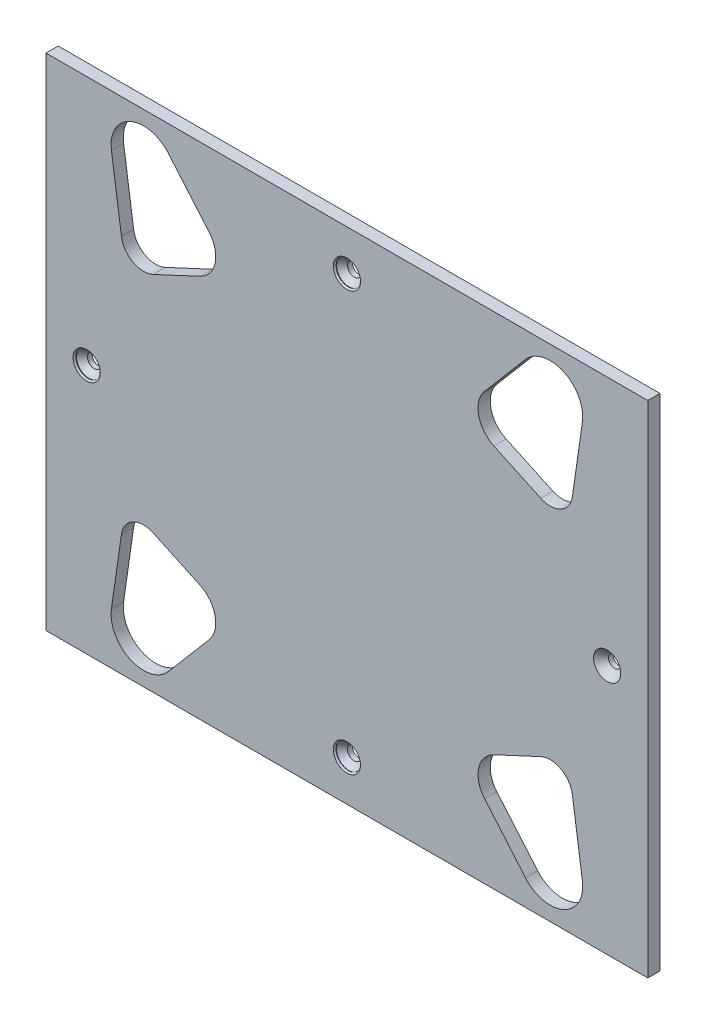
ISO-10303-21;
HEADER;
FILE_DESCRIPTION(('STEP AP214'),'2;1');
FILE_NAME('part.step','',(''),(''),'','','');
FILE_SCHEMA(('AUTOMOTIVE_DESIGN { 1 0 10303 214 1 1 1 1 }'));
ENDSEC;
DATA;
#1=APPLICATION_CONTEXT('core data for automotive mechanical design processes');
#2=APPLICATION_PROTOCOL_DEFINITION('international standard','automotive_design',2000,#1);
#3=PRODUCT_CONTEXT('',#1,'mechanical');
#4=PRODUCT('Part','Part','',(#3));
#5=PRODUCT_RELATED_PRODUCT_CATEGORY('part','',(#4));
#6=PRODUCT_DEFINITION_FORMATION('','',#4);
#7=PRODUCT_DEFINITION_CONTEXT('part definition',#1,'design');
#8=PRODUCT_DEFINITION('design','',#6,#7);
#9=PRODUCT_DEFINITION_SHAPE('','',#8);
#10=(LENGTH_UNIT() NAMED_UNIT(*) SI_UNIT(.MILLI.,.METRE.));
#11=(NAMED_UNIT(*) PLANE_ANGLE_UNIT() SI_UNIT($,.RADIAN.));
#12=(NAMED_UNIT(*) SI_UNIT($,.STERADIAN.) SOLID_ANGLE_UNIT());
#13=UNCERTAINTY_MEASURE_WITH_UNIT(LENGTH_MEASURE(1.E-05),#10,'distance_accuracy_value','');
#14=(GEOMETRIC_REPRESENTATION_CONTEXT(3) GLOBAL_UNCERTAINTY_ASSIGNED_CONTEXT((#13)) GLOBAL_UNIT_ASSIGNED_CONTEXT((#10,
#11,#12)) REPRESENTATION_CONTEXT('',''));
#15=CARTESIAN_POINT('',(0.,0.,0.));
#16=DIRECTION('',(0.,0.,1.));
#17=DIRECTION('',(1.,0.,0.));
#18=AXIS2_PLACEMENT_3D('',#15,#16,#17);
#19=CARTESIAN_POINT('',(-128.,0.,55.2134967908));
#20=DIRECTION('',(0.,0.,-1.));
#21=DIRECTION('',(-1.,0.,0.));
#22=AXIS2_PLACEMENT_3D('',#19,#20,#21);
#23=CYLINDRICAL_SURFACE('',#22,6.);
#24=CARTESIAN_POINT('',(-128.,0.,5.01349679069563));
#25=DIRECTION('',(0.,0.,1.));
#26=DIRECTION('',(0.877582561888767,-0.479425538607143,0.));
#27=AXIS2_PLACEMENT_3D('',#24,#25,#26);
#28=CIRCLE('',#27,5.9999999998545);
#29=CARTESIAN_POINT('',(-122.734504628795,-2.8765532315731,5.01349679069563));
#30=VERTEX_POINT('',#29);
#31=EDGE_CURVE('E237',#30,#30,#28,.F.);
#32=ORIENTED_EDGE('',*,*,#31,.T.);
#33=EDGE_LOOP('',(#32));
#34=FACE_BOUND('',#33,.T.);
#35=CARTESIAN_POINT('',(-128.,0.,5.2999999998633));
#36=DIRECTION('',(0.,0.,1.));
#37=DIRECTION('',(0.877582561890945,-0.479425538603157,0.));
#38=AXIS2_PLACEMENT_3D('',#35,#36,#37);
#39=CIRCLE('',#38,5.99999999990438);
#40=CARTESIAN_POINT('',(-122.734504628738,-2.8765532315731,5.2999999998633));
#41=VERTEX_POINT('',#40);
#42=EDGE_CURVE('E240',#41,#41,#39,.T.);
#43=ORIENTED_EDGE('',*,*,#42,.T.);
#44=EDGE_LOOP('',(#43));
#45=FACE_BOUND('',#44,.T.);
#46=ADVANCED_FACE('F16',(#34,#45),#23,.F.);
#47=CARTESIAN_POINT('',(0.,-103.,55.3155203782));
#48=DIRECTION('',(0.,0.,-1.));
#49=DIRECTION('',(-1.,0.,0.));
#50=AXIS2_PLACEMENT_3D('',#47,#48,#49);
#51=CYLINDRICAL_SURFACE('',#50,6.);
#52=CARTESIAN_POINT('',(0.,-103.,5.11552037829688));
#53=DIRECTION('',(0.,0.,1.));
#54=DIRECTION('',(0.877582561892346,-0.479425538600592,0.));
#55=AXIS2_PLACEMENT_3D('',#52,#53,#54);
#56=CIRCLE('',#55,6.00000000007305);
#57=CARTESIAN_POINT('',(5.26549537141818,-105.876553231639,5.11552037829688));
#58=VERTEX_POINT('',#57);
#59=EDGE_CURVE('E234',#58,#58,#56,.F.);
#60=ORIENTED_EDGE('',*,*,#59,.T.);
#61=EDGE_LOOP('',(#60));
#62=FACE_BOUND('',#61,.T.);
#63=CARTESIAN_POINT('',(0.,-103.,5.30000000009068));
#64=DIRECTION('',(0.,0.,1.));
#65=DIRECTION('',(0.87758256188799,-0.479425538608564,0.));
#66=AXIS2_PLACEMENT_3D('',#63,#64,#65);
#67=CIRCLE('',#66,5.99999999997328);
#68=CARTESIAN_POINT('',(5.2654953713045,-105.876553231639,5.30000000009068));
#69=VERTEX_POINT('',#68);
#70=EDGE_CURVE('E243',#69,#69,#67,.T.);
#71=ORIENTED_EDGE('',*,*,#70,.T.);
#72=EDGE_LOOP('',(#71));
#73=FACE_BOUND('',#72,.T.);
#74=ADVANCED_FACE('F872',(#62,#73),#51,.F.);
#75=CARTESIAN_POINT('',(0.,103.,55.2576178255));
#76=DIRECTION('',(0.,0.,-1.));
#77=DIRECTION('',(-1.,0.,0.));
#78=AXIS2_PLACEMENT_3D('',#75,#76,#77);
#79=CYLINDRICAL_SURFACE('',#78,6.);
#80=CARTESIAN_POINT('',(0.,103.,5.05761782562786));
#81=DIRECTION('',(0.,0.,1.));
#82=DIRECTION('',(0.877582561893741,-0.479425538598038,0.));
#83=AXIS2_PLACEMENT_3D('',#80,#81,#82);
#84=CIRCLE('',#83,6.00000000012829);
#85=CARTESIAN_POINT('',(5.26549537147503,100.12344676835,5.05761782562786));
#86=VERTEX_POINT('',#85);
#87=EDGE_CURVE('E231',#86,#86,#84,.F.);
#88=ORIENTED_EDGE('',*,*,#87,.T.);
#89=EDGE_LOOP('',(#88));
#90=FACE_BOUND('',#89,.T.);
#91=CARTESIAN_POINT('',(0.,103.,5.30000000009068));
#92=DIRECTION('',(0.,0.,1.));
#93=DIRECTION('',(0.877582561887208,-0.479425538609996,0.));
#94=AXIS2_PLACEMENT_3D('',#91,#92,#93);
#95=CIRCLE('',#94,5.99999999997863);
#96=CARTESIAN_POINT('',(5.2654953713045,100.12344676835,5.30000000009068));
#97=VERTEX_POINT('',#96);
#98=EDGE_CURVE('E246',#97,#97,#95,.T.);
#99=ORIENTED_EDGE('',*,*,#98,.T.);
#100=EDGE_LOOP('',(#99));
#101=FACE_BOUND('',#100,.T.);
#102=ADVANCED_FACE('F864',(#90,#101),#79,.F.);
#103=CARTESIAN_POINT('',(0.,103.,6.00000000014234));
#104=DIRECTION('',(0.,0.,1.));
#105=DIRECTION('',(1.,0.,0.));
#106=AXIS2_PLACEMENT_3D('',#103,#104,#105);
#107=CONICAL_SURFACE('',#106,6.70000000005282,0.785398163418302);
#108=CARTESIAN_POINT('',(0.,103.,6.00000000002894));
#109=DIRECTION('',(0.,0.,1.));
#110=DIRECTION('',(1.,0.,0.));
#111=AXIS2_PLACEMENT_3D('',#108,#109,#110);
#112=CIRCLE('',#111,6.69999999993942);
#113=CARTESIAN_POINT('',(6.69999999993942,103.,6.00000000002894));
#114=VERTEX_POINT('',#113);
#115=EDGE_CURVE('E350',#114,#114,#112,.F.);
#116=ORIENTED_EDGE('',*,*,#115,.F.);
#117=EDGE_LOOP('',(#116));
#118=FACE_BOUND('',#117,.T.);
#119=ORIENTED_EDGE('',*,*,#98,.F.);
#120=EDGE_LOOP('',(#119));
#121=FACE_BOUND('',#120,.T.);
#122=ADVANCED_FACE('F856',(#118,#121),#107,.F.);
#123=CARTESIAN_POINT('',(0.,-103.,6.00000000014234));
#124=DIRECTION('',(0.,0.,1.));
#125=DIRECTION('',(1.,0.,0.));
#126=AXIS2_PLACEMENT_3D('',#123,#124,#125);
#127=CONICAL_SURFACE('',#126,6.70000000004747,0.785398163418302);
#128=CARTESIAN_POINT('',(0.,-103.,6.00000000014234));
#129=DIRECTION('',(0.,0.,1.));
#130=DIRECTION('',(1.,0.,0.));
#131=AXIS2_PLACEMENT_3D('',#128,#129,#130);
#132=CIRCLE('',#131,6.70000000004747);
#133=CARTESIAN_POINT('',(6.70000000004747,-103.,6.00000000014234));
#134=VERTEX_POINT('',#133);
#135=EDGE_CURVE('E348',#134,#134,#132,.F.);
#136=ORIENTED_EDGE('',*,*,#135,.F.);
#137=EDGE_LOOP('',(#136));
#138=FACE_BOUND('',#137,.T.);
#139=ORIENTED_EDGE('',*,*,#70,.F.);
#140=EDGE_LOOP('',(#139));
#141=FACE_BOUND('',#140,.T.);
#142=ADVANCED_FACE('F848',(#138,#141),#127,.F.);
#143=CARTESIAN_POINT('',(-128.,0.,6.00000000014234));
#144=DIRECTION('',(0.,0.,1.));
#145=DIRECTION('',(1.,0.,0.));
#146=AXIS2_PLACEMENT_3D('',#143,#144,#145);
#147=CONICAL_SURFACE('',#146,6.70000000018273,0.785398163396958);
#148=CARTESIAN_POINT('',(-128.,0.,6.00000000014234));
#149=DIRECTION('',(0.,0.,1.));
#150=DIRECTION('',(1.,0.,0.));
#151=AXIS2_PLACEMENT_3D('',#148,#149,#150);
#152=CIRCLE('',#151,6.70000000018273);
#153=CARTESIAN_POINT('',(-121.299999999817,0.,6.00000000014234));
#154=VERTEX_POINT('',#153);
#155=EDGE_CURVE('E344',#154,#154,#152,.F.);
#156=ORIENTED_EDGE('',*,*,#155,.F.);
#157=EDGE_LOOP('',(#156));
#158=FACE_BOUND('',#157,.T.);
#159=ORIENTED_EDGE('',*,*,#42,.F.);
#160=EDGE_LOOP('',(#159));
#161=FACE_BOUND('',#160,.T.);
#162=ADVANCED_FACE('F840',(#158,#161),#147,.F.);
#163=CARTESIAN_POINT('',(-128.,0.,5.01349679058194));
#164=DIRECTION('',(0.,0.,1.));
#165=DIRECTION('',(1.,0.,0.));
#166=AXIS2_PLACEMENT_3D('',#163,#164,#165);
#167=CONICAL_SURFACE('',#166,5.99999999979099,0.785398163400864);
#168=ORIENTED_EDGE('',*,*,#31,.F.);
#169=EDGE_LOOP('',(#168));
#170=FACE_BOUND('',#169,.T.);
#171=CARTESIAN_POINT('',(-128.,0.,2.3134967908));
#172=DIRECTION('',(0.,0.,-1.));
#173=DIRECTION('',(-1.,0.,0.));
#174=AXIS2_PLACEMENT_3D('',#171,#172,#173);
#175=CIRCLE('',#174,3.3);
#176=CARTESIAN_POINT('',(-131.3,0.,2.3134967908));
#177=VERTEX_POINT('',#176);
#178=EDGE_CURVE('E227',#177,#177,#175,.T.);
#179=ORIENTED_EDGE('',*,*,#178,.T.);
#180=EDGE_LOOP('',(#179));
#181=FACE_BOUND('',#180,.T.);
#182=ADVANCED_FACE('F832',(#170,#181),#167,.F.);
#183=CARTESIAN_POINT('',(0.,-103.,5.11552037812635));
#184=DIRECTION('',(0.,0.,1.));
#185=DIRECTION('',(0.,-1.,0.));
#186=AXIS2_PLACEMENT_3D('',#183,#184,#185);
#187=CONICAL_SURFACE('',#186,5.99999999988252,0.785398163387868);
#188=ORIENTED_EDGE('',*,*,#59,.F.);
#189=EDGE_LOOP('',(#188));
#190=FACE_BOUND('',#189,.T.);
#191=CARTESIAN_POINT('',(0.,-103.,2.41552037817));
#192=DIRECTION('',(0.,0.,-1.));
#193=DIRECTION('',(-1.,0.,0.));
#194=AXIS2_PLACEMENT_3D('',#191,#192,#193);
#195=CIRCLE('',#194,3.3);
#196=CARTESIAN_POINT('',(-3.3,-103.,2.41552037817));
#197=VERTEX_POINT('',#196);
#198=EDGE_CURVE('E224',#197,#197,#195,.T.);
#199=ORIENTED_EDGE('',*,*,#198,.T.);
#200=EDGE_LOOP('',(#199));
#201=FACE_BOUND('',#200,.T.);
#202=ADVANCED_FACE('F371',(#190,#201),#187,.F.);
#203=CARTESIAN_POINT('',(0.,103.,5.05761782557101));
#204=DIRECTION('',(0.,0.,1.));
#205=DIRECTION('',(0.,-1.,0.));
#206=AXIS2_PLACEMENT_3D('',#203,#204,#205);
#207=CONICAL_SURFACE('',#206,6.00000000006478,0.785398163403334);
#208=ORIENTED_EDGE('',*,*,#87,.F.);
#209=EDGE_LOOP('',(#208));
#210=FACE_BOUND('',#209,.T.);
#211=CARTESIAN_POINT('',(0.,103.,2.35761782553));
#212=DIRECTION('',(0.,0.,-1.));
#213=DIRECTION('',(-1.,0.,0.));
#214=AXIS2_PLACEMENT_3D('',#211,#212,#213);
#215=CIRCLE('',#214,3.3);
#216=CARTESIAN_POINT('',(-3.3,103.,2.35761782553));
#217=VERTEX_POINT('',#216);
#218=EDGE_CURVE('E221',#217,#217,#215,.T.);
#219=ORIENTED_EDGE('',*,*,#218,.T.);
#220=EDGE_LOOP('',(#219));
#221=FACE_BOUND('',#220,.T.);
#222=ADVANCED_FACE('F360',(#210,#221),#207,.F.);
#223=CARTESIAN_POINT('',(128.,0.,6.00000000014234));
#224=DIRECTION('',(0.,0.,1.));
#225=DIRECTION('',(1.,0.,0.));
#226=AXIS2_PLACEMENT_3D('',#223,#224,#225);
#227=CONICAL_SURFACE('',#226,6.70000000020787,0.785398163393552);
#228=CARTESIAN_POINT('',(128.,0.,2.3));
#229=DIRECTION('',(0.,0.,-1.));
#230=DIRECTION('',(-1.,0.,0.));
#231=AXIS2_PLACEMENT_3D('',#228,#229,#230);
#232=CIRCLE('',#231,3.);
#233=CARTESIAN_POINT('',(125.,0.,2.3));
#234=VERTEX_POINT('',#233);
#235=EDGE_CURVE('E189',#234,#234,#232,.T.);
#236=ORIENTED_EDGE('',*,*,#235,.T.);
#237=EDGE_LOOP('',(#236));
#238=FACE_BOUND('',#237,.T.);
#239=CARTESIAN_POINT('',(128.,0.,6.00000000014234));
#240=DIRECTION('',(0.,0.,1.));
#241=DIRECTION('',(1.,0.,0.));
#242=AXIS2_PLACEMENT_3D('',#239,#240,#241);
#243=CIRCLE('',#242,6.70000000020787);
#244=CARTESIAN_POINT('',(134.700000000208,0.,6.00000000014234));
#245=VERTEX_POINT('',#244);
#246=EDGE_CURVE('E20',#245,#245,#243,.F.);
#247=ORIENTED_EDGE('',*,*,#246,.F.);
#248=EDGE_LOOP('',(#247));
#249=FACE_BOUND('',#248,.T.);
#250=ADVANCED_FACE('F358',(#238,#249),#227,.F.);
#251=CARTESIAN_POINT('',(0.,0.,6.));
#252=DIRECTION('',(0.,0.,1.));
#253=DIRECTION('',(1.,0.,0.));
#254=AXIS2_PLACEMENT_3D('',#251,#252,#253);
#255=PLANE('',#254);
#256=ORIENTED_EDGE('',*,*,#155,.T.);
#257=EDGE_LOOP('',(#256));
#258=FACE_BOUND('',#257,.T.);
#259=ORIENTED_EDGE('',*,*,#135,.T.);
#260=EDGE_LOOP('',(#259));
#261=FACE_BOUND('',#260,.T.);
#262=ORIENTED_EDGE('',*,*,#115,.T.);
#263=EDGE_LOOP('',(#262));
#264=FACE_BOUND('',#263,.T.);
#265=CARTESIAN_POINT('',(-100.,100.,6.));
#266=DIRECTION('',(0.,0.,1.));
#267=DIRECTION('',(1.,0.,0.));
#268=AXIS2_PLACEMENT_3D('',#265,#266,#267);
#269=CIRCLE('',#268,16.);
#270=CARTESIAN_POINT('',(-115.835893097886,97.7142857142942,6.));
#271=VERTEX_POINT('',#270);
#272=CARTESIAN_POINT('',(-87.8137838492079,110.368034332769,6.));
#273=VERTEX_POINT('',#272);
#274=EDGE_CURVE('E306',#271,#273,#269,.F.);
#275=ORIENTED_EDGE('',*,*,#274,.T.);
#276=DIRECTION('',(-0.648002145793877,0.761638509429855,0.));
#277=VECTOR('',#276,1.);
#278=CARTESIAN_POINT('',(-67.7178801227,86.7480289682,6.));
#279=LINE('',#278,#277);
#280=CARTESIAN_POINT('',(-67.7178801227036,86.7480289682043,6.));
#281=VERTEX_POINT('',#280);
#282=EDGE_CURVE('E435',#273,#281,#279,.F.);
#283=ORIENTED_EDGE('',*,*,#282,.T.);
#284=CARTESIAN_POINT('',(-78.,78.,6.));
#285=DIRECTION('',(0.,0.,1.));
#286=DIRECTION('',(1.,0.,0.));
#287=AXIS2_PLACEMENT_3D('',#284,#285,#286);
#288=CIRCLE('',#287,13.5);
#289=CARTESIAN_POINT('',(-72.3021598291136,65.7613474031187,6.));
#290=VERTEX_POINT('',#289);
#291=EDGE_CURVE('E314',#281,#290,#288,.F.);
#292=ORIENTED_EDGE('',*,*,#291,.T.);
#293=DIRECTION('',(0.906566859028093,0.422062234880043,0.));
#294=VECTOR('',#293,1.);
#295=CARTESIAN_POINT('',(-95.3573154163,55.0277645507,6.));
#296=LINE('',#295,#294);
#297=CARTESIAN_POINT('',(-95.3573154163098,55.0277645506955,6.));
#298=VERTEX_POINT('',#297);
#299=EDGE_CURVE('E449',#290,#298,#296,.F.);
#300=ORIENTED_EDGE('',*,*,#299,.T.);
#301=CARTESIAN_POINT('',(-100.,65.,6.));
#302=DIRECTION('',(0.,0.,1.));
#303=DIRECTION('',(1.,0.,0.));
#304=AXIS2_PLACEMENT_3D('',#301,#302,#303);
#305=CIRCLE('',#304,11.);
#306=CARTESIAN_POINT('',(-110.88717650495,63.4285714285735,6.));
#307=VERTEX_POINT('',#306);
#308=EDGE_CURVE('E310',#298,#307,#305,.F.);
#309=ORIENTED_EDGE('',*,*,#308,.T.);
#310=DIRECTION('',(0.142857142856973,-0.989743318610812,0.));
#311=VECTOR('',#310,1.);
#312=CARTESIAN_POINT('',(-115.835893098,97.7142857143,6.));
#313=LINE('',#312,#311);
#314=EDGE_CURVE('E444',#307,#271,#313,.F.);
#315=ORIENTED_EDGE('',*,*,#314,.T.);
#316=EDGE_LOOP('',(#275,#283,#292,#300,#309,#315));
#317=FACE_BOUND('',#316,.T.);
#318=DIRECTION('',(0.648002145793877,0.761638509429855,0.));
#319=VECTOR('',#318,1.);
#320=CARTESIAN_POINT('',(67.7178801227,86.7480289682,6.));
#321=LINE('',#320,#319);
#322=CARTESIAN_POINT('',(87.8137838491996,110.368034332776,6.));
#323=VERTEX_POINT('',#322);
#324=CARTESIAN_POINT('',(67.7178801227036,86.7480289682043,6.));
#325=VERTEX_POINT('',#324);
#326=EDGE_CURVE('E455',#323,#325,#321,.F.);
#327=ORIENTED_EDGE('',*,*,#326,.F.);
#328=CARTESIAN_POINT('',(100.,100.,6.));
#329=DIRECTION('',(0.,0.,1.));
#330=DIRECTION('',(1.,0.,0.));
#331=AXIS2_PLACEMENT_3D('',#328,#329,#330);
#332=CIRCLE('',#331,16.);
#333=CARTESIAN_POINT('',(115.835893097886,97.7142857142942,6.));
#334=VERTEX_POINT('',#333);
#335=EDGE_CURVE('E317',#323,#334,#332,.F.);
#336=ORIENTED_EDGE('',*,*,#335,.T.);
#337=DIRECTION('',(-0.142857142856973,-0.989743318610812,0.));
#338=VECTOR('',#337,1.);
#339=CARTESIAN_POINT('',(115.835893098,97.7142857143,6.));
#340=LINE('',#339,#338);
#341=CARTESIAN_POINT('',(110.887176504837,63.4285714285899,6.));
#342=VERTEX_POINT('',#341);
#343=EDGE_CURVE('E332',#342,#334,#340,.F.);
#344=ORIENTED_EDGE('',*,*,#343,.F.);
#345=CARTESIAN_POINT('',(100.,65.,6.));
#346=DIRECTION('',(0.,0.,1.));
#347=DIRECTION('',(1.,0.,0.));
#348=AXIS2_PLACEMENT_3D('',#345,#346,#347);
#349=CIRCLE('',#348,11.);
#350=CARTESIAN_POINT('',(95.3573154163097,55.0277645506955,6.));
#351=VERTEX_POINT('',#350);
#352=EDGE_CURVE('E325',#342,#351,#349,.F.);
#353=ORIENTED_EDGE('',*,*,#352,.T.);
#354=DIRECTION('',(-0.906566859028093,0.422062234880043,0.));
#355=VECTOR('',#354,1.);
#356=CARTESIAN_POINT('',(95.3573154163,55.0277645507,6.));
#357=LINE('',#356,#355);
#358=CARTESIAN_POINT('',(72.3021598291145,65.7613474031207,6.));
#359=VERTEX_POINT('',#358);
#360=EDGE_CURVE('E461',#359,#351,#357,.F.);
#361=ORIENTED_EDGE('',*,*,#360,.F.);
#362=CARTESIAN_POINT('',(78.,78.,6.));
#363=DIRECTION('',(0.,0.,1.));
#364=DIRECTION('',(1.,0.,0.));
#365=AXIS2_PLACEMENT_3D('',#362,#363,#364);
#366=CIRCLE('',#365,13.5);
#367=EDGE_CURVE('E321',#359,#325,#366,.F.);
#368=ORIENTED_EDGE('',*,*,#367,.T.);
#369=EDGE_LOOP('',(#327,#336,#344,#353,#361,#368));
#370=FACE_BOUND('',#369,.T.);
#371=DIRECTION('',(-0.648002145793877,-0.761638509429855,0.));
#372=VECTOR('',#371,1.);
#373=CARTESIAN_POINT('',(-67.7178801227,-86.7480289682,6.));
#374=LINE('',#373,#372);
#375=CARTESIAN_POINT('',(-87.8137838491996,-110.368034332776,6.));
#376=VERTEX_POINT('',#375);
#377=CARTESIAN_POINT('',(-67.7178801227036,-86.7480289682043,6.));
#378=VERTEX_POINT('',#377);
#379=EDGE_CURVE('E468',#376,#378,#374,.F.);
#380=ORIENTED_EDGE('',*,*,#379,.F.);
#381=CARTESIAN_POINT('',(-100.,-100.,6.));
#382=DIRECTION('',(0.,0.,1.));
#383=DIRECTION('',(1.,0.,0.));
#384=AXIS2_PLACEMENT_3D('',#381,#382,#383);
#385=CIRCLE('',#384,16.);
#386=CARTESIAN_POINT('',(-115.835893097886,-97.7142857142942,6.));
#387=VERTEX_POINT('',#386);
#388=EDGE_CURVE('E329',#376,#387,#385,.F.);
#389=ORIENTED_EDGE('',*,*,#388,.T.);
#390=DIRECTION('',(0.142857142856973,0.989743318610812,0.));
#391=VECTOR('',#390,1.);
#392=CARTESIAN_POINT('',(-115.835893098,-97.7142857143,6.));
#393=LINE('',#392,#391);
#394=CARTESIAN_POINT('',(-110.887176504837,-63.4285714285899,6.));
#395=VERTEX_POINT('',#394);
#396=EDGE_CURVE('E204',#395,#387,#393,.F.);
#397=ORIENTED_EDGE('',*,*,#396,.F.);
#398=CARTESIAN_POINT('',(-100.,-65.,6.));
#399=DIRECTION('',(0.,0.,1.));
#400=DIRECTION('',(1.,0.,0.));
#401=AXIS2_PLACEMENT_3D('',#398,#399,#400);
#402=CIRCLE('',#401,11.);
#403=CARTESIAN_POINT('',(-95.3573154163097,-55.0277645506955,6.));
#404=VERTEX_POINT('',#403);
#405=EDGE_CURVE('E338',#395,#404,#402,.F.);
#406=ORIENTED_EDGE('',*,*,#405,.T.);
#407=DIRECTION('',(0.906566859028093,-0.422062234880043,0.));
#408=VECTOR('',#407,1.);
#409=CARTESIAN_POINT('',(-95.3573154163,-55.0277645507,6.));
#410=LINE('',#409,#408);
#411=CARTESIAN_POINT('',(-72.3021598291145,-65.7613474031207,6.));
#412=VERTEX_POINT('',#411);
#413=EDGE_CURVE('E211',#412,#404,#410,.F.);
#414=ORIENTED_EDGE('',*,*,#413,.F.);
#415=CARTESIAN_POINT('',(-78.,-78.,6.));
#416=DIRECTION('',(0.,0.,1.));
#417=DIRECTION('',(1.,0.,0.));
#418=AXIS2_PLACEMENT_3D('',#415,#416,#417);
#419=CIRCLE('',#418,13.5);
#420=EDGE_CURVE('E334',#412,#378,#419,.F.);
#421=ORIENTED_EDGE('',*,*,#420,.T.);
#422=EDGE_LOOP('',(#380,#389,#397,#406,#414,#421));
#423=FACE_BOUND('',#422,.T.);
#424=CARTESIAN_POINT('',(100.,-100.,6.));
#425=DIRECTION('',(0.,0.,1.));
#426=DIRECTION('',(1.,0.,0.));
#427=AXIS2_PLACEMENT_3D('',#424,#425,#426);
#428=CIRCLE('',#427,16.);
#429=CARTESIAN_POINT('',(115.835893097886,-97.7142857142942,6.));
#430=VERTEX_POINT('',#429);
#431=CARTESIAN_POINT('',(87.8137838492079,-110.368034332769,6.));
#432=VERTEX_POINT('',#431);
#433=EDGE_CURVE('E199',#430,#432,#428,.F.);
#434=ORIENTED_EDGE('',*,*,#433,.T.);
#435=DIRECTION('',(0.648002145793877,-0.761638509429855,0.));
#436=VECTOR('',#435,1.);
#437=CARTESIAN_POINT('',(67.7178801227,-86.7480289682,6.));
#438=LINE('',#437,#436);
#439=CARTESIAN_POINT('',(67.7178801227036,-86.7480289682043,6.));
#440=VERTEX_POINT('',#439);
#441=EDGE_CURVE('E194',#432,#440,#438,.F.);
#442=ORIENTED_EDGE('',*,*,#441,.T.);
#443=CARTESIAN_POINT('',(78.,-78.,6.));
#444=DIRECTION('',(0.,0.,1.));
#445=DIRECTION('',(1.,0.,0.));
#446=AXIS2_PLACEMENT_3D('',#443,#444,#445);
#447=CIRCLE('',#446,13.5);
#448=CARTESIAN_POINT('',(72.3021598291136,-65.7613474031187,6.));
#449=VERTEX_POINT('',#448);
#450=EDGE_CURVE('E179',#440,#449,#447,.F.);
#451=ORIENTED_EDGE('',*,*,#450,.T.);
#452=DIRECTION('',(-0.906566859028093,-0.422062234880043,0.));
#453=VECTOR('',#452,1.);
#454=CARTESIAN_POINT('',(95.3573154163,-55.0277645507,6.));
#455=LINE('',#454,#453);
#456=CARTESIAN_POINT('',(95.3573154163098,-55.0277645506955,6.));
#457=VERTEX_POINT('',#456);
#458=EDGE_CURVE('E216',#449,#457,#455,.F.);
#459=ORIENTED_EDGE('',*,*,#458,.T.);
#460=CARTESIAN_POINT('',(100.,-65.,6.));
#461=DIRECTION('',(0.,0.,1.));
#462=DIRECTION('',(1.,0.,0.));
#463=AXIS2_PLACEMENT_3D('',#460,#461,#462);
#464=CIRCLE('',#463,11.);
#465=CARTESIAN_POINT('',(110.88717650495,-63.4285714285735,6.));
#466=VERTEX_POINT('',#465);
#467=EDGE_CURVE('E342',#457,#466,#464,.F.);
#468=ORIENTED_EDGE('',*,*,#467,.T.);
#469=DIRECTION('',(-0.142857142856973,0.989743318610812,0.));
#470=VECTOR('',#469,1.);
#471=CARTESIAN_POINT('',(115.835893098,-97.7142857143,6.));
#472=LINE('',#471,#470);
#473=EDGE_CURVE('E212',#466,#430,#472,.F.);
#474=ORIENTED_EDGE('',*,*,#473,.T.);
#475=EDGE_LOOP('',(#434,#442,#451,#459,#468,#474));
#476=FACE_BOUND('',#475,.T.);
#477=ORIENTED_EDGE('',*,*,#246,.T.);
#478=EDGE_LOOP('',(#477));
#479=FACE_BOUND('',#478,.T.);
#480=DIRECTION('',(1.,0.,0.));
#481=VECTOR('',#480,1.);
#482=CARTESIAN_POINT('',(148.,-123.,6.));
#483=LINE('',#482,#481);
#484=CARTESIAN_POINT('',(-148.,-123.,6.));
#485=VERTEX_POINT('',#484);
#486=CARTESIAN_POINT('',(148.,-123.,6.));
#487=VERTEX_POINT('',#486);
#488=EDGE_CURVE('E545',#485,#487,#483,.T.);
#489=ORIENTED_EDGE('',*,*,#488,.T.);
#490=DIRECTION('',(0.,1.,0.));
#491=VECTOR('',#490,1.);
#492=CARTESIAN_POINT('',(148.,123.,6.));
#493=LINE('',#492,#491);
#494=CARTESIAN_POINT('',(148.,123.,6.));
#495=VERTEX_POINT('',#494);
#496=EDGE_CURVE('E542',#487,#495,#493,.T.);
#497=ORIENTED_EDGE('',*,*,#496,.T.);
#498=DIRECTION('',(1.,0.,0.));
#499=VECTOR('',#498,1.);
#500=CARTESIAN_POINT('',(-148.,123.,6.));
#501=LINE('',#500,#499);
#502=CARTESIAN_POINT('',(-148.,123.,6.));
#503=VERTEX_POINT('',#502);
#504=EDGE_CURVE('E347',#495,#503,#501,.F.);
#505=ORIENTED_EDGE('',*,*,#504,.T.);
#506=DIRECTION('',(0.,1.,0.));
#507=VECTOR('',#506,1.);
#508=CARTESIAN_POINT('',(-148.,-123.,6.));
#509=LINE('',#508,#507);
#510=EDGE_CURVE('E538',#503,#485,#509,.F.);
#511=ORIENTED_EDGE('',*,*,#510,.T.);
#512=EDGE_LOOP('',(#489,#497,#505,#511));
#513=FACE_BOUND('',#512,.T.);
#514=ADVANCED_FACE('F201',(#258,#261,#264,#317,#370,#423,#476,#479,#513),#255,.T.);
#515=CARTESIAN_POINT('',(-148.,123.,0.));
#516=DIRECTION('',(0.,-1.,0.));
#517=DIRECTION('',(0.,0.,-1.));
#518=AXIS2_PLACEMENT_3D('',#515,#516,#517);
#519=PLANE('',#518);
#520=DIRECTION('',(1.,0.,0.));
#521=VECTOR('',#520,1.);
#522=CARTESIAN_POINT('',(0.,123.,0.));
#523=LINE('',#522,#521);
#524=CARTESIAN_POINT('',(148.,123.,0.));
#525=VERTEX_POINT('',#524);
#526=CARTESIAN_POINT('',(-148.,123.,0.));
#527=VERTEX_POINT('',#526);
#528=EDGE_CURVE('E433',#525,#527,#523,.F.);
#529=ORIENTED_EDGE('',*,*,#528,.T.);
#530=DIRECTION('',(0.,0.,-1.));
#531=VECTOR('',#530,1.);
#532=CARTESIAN_POINT('',(-148.,123.,0.));
#533=LINE('',#532,#531);
#534=EDGE_CURVE('E432',#527,#503,#533,.F.);
#535=ORIENTED_EDGE('',*,*,#534,.T.);
#536=ORIENTED_EDGE('',*,*,#504,.F.);
#537=DIRECTION('',(0.,0.,1.));
#538=VECTOR('',#537,1.);
#539=CARTESIAN_POINT('',(148.,123.,0.));
#540=LINE('',#539,#538);
#541=EDGE_CURVE('E525',#495,#525,#540,.F.);
#542=ORIENTED_EDGE('',*,*,#541,.T.);
#543=EDGE_LOOP('',(#529,#535,#536,#542));
#544=FACE_BOUND('',#543,.T.);
#545=ADVANCED_FACE('F368',(#544),#519,.F.);
#546=CARTESIAN_POINT('',(-148.,-123.,0.));
#547=DIRECTION('',(1.,0.,0.));
#548=DIRECTION('',(0.,0.,-1.));
#549=AXIS2_PLACEMENT_3D('',#546,#547,#548);
#550=PLANE('',#549);
#551=DIRECTION('',(0.,1.,0.));
#552=VECTOR('',#551,1.);
#553=CARTESIAN_POINT('',(-148.,0.,0.));
#554=LINE('',#553,#552);
#555=CARTESIAN_POINT('',(-148.,-123.,0.));
#556=VERTEX_POINT('',#555);
#557=EDGE_CURVE('E416',#527,#556,#554,.F.);
#558=ORIENTED_EDGE('',*,*,#557,.T.);
#559=DIRECTION('',(0.,0.,1.));
#560=VECTOR('',#559,1.);
#561=CARTESIAN_POINT('',(-148.,-123.,0.));
#562=LINE('',#561,#560);
#563=EDGE_CURVE('E430',#556,#485,#562,.T.);
#564=ORIENTED_EDGE('',*,*,#563,.T.);
#565=ORIENTED_EDGE('',*,*,#510,.F.);
#566=ORIENTED_EDGE('',*,*,#534,.F.);
#567=EDGE_LOOP('',(#558,#564,#565,#566));
#568=FACE_BOUND('',#567,.T.);
#569=ADVANCED_FACE('F427',(#568),#550,.F.);
#570=CARTESIAN_POINT('',(148.,-123.,0.));
#571=DIRECTION('',(0.,1.,0.));
#572=DIRECTION('',(0.,0.,1.));
#573=AXIS2_PLACEMENT_3D('',#570,#571,#572);
#574=PLANE('',#573);
#575=DIRECTION('',(1.,0.,0.));
#576=VECTOR('',#575,1.);
#577=CARTESIAN_POINT('',(0.,-123.,0.));
#578=LINE('',#577,#576);
#579=CARTESIAN_POINT('',(148.,-123.,0.));
#580=VERTEX_POINT('',#579);
#581=EDGE_CURVE('E412',#556,#580,#578,.T.);
#582=ORIENTED_EDGE('',*,*,#581,.T.);
#583=DIRECTION('',(0.,0.,1.));
#584=VECTOR('',#583,1.);
#585=CARTESIAN_POINT('',(148.,-123.,0.));
#586=LINE('',#585,#584);
#587=EDGE_CURVE('E230',#580,#487,#586,.T.);
#588=ORIENTED_EDGE('',*,*,#587,.T.);
#589=ORIENTED_EDGE('',*,*,#488,.F.);
#590=ORIENTED_EDGE('',*,*,#563,.F.);
#591=EDGE_LOOP('',(#582,#588,#589,#590));
#592=FACE_BOUND('',#591,.T.);
#593=ADVANCED_FACE('F797',(#592),#574,.F.);
#594=CARTESIAN_POINT('',(148.,123.,0.));
#595=DIRECTION('',(-1.,0.,0.));
#596=DIRECTION('',(0.,0.,1.));
#597=AXIS2_PLACEMENT_3D('',#594,#595,#596);
#598=PLANE('',#597);
#599=DIRECTION('',(0.,1.,0.));
#600=VECTOR('',#599,1.);
#601=CARTESIAN_POINT('',(148.,0.,0.));
#602=LINE('',#601,#600);
#603=EDGE_CURVE('E305',#580,#525,#602,.T.);
#604=ORIENTED_EDGE('',*,*,#603,.T.);
#605=ORIENTED_EDGE('',*,*,#541,.F.);
#606=ORIENTED_EDGE('',*,*,#496,.F.);
#607=ORIENTED_EDGE('',*,*,#587,.F.);
#608=EDGE_LOOP('',(#604,#605,#606,#607));
#609=FACE_BOUND('',#608,.T.);
#610=ADVANCED_FACE('F521',(#609),#598,.F.);
#611=CARTESIAN_POINT('',(-128.,0.,55.2134967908));
#612=DIRECTION('',(0.,0.,-1.));
#613=DIRECTION('',(-1.,0.,0.));
#614=AXIS2_PLACEMENT_3D('',#611,#612,#613);
#615=CYLINDRICAL_SURFACE('',#614,3.3);
#616=ORIENTED_EDGE('',*,*,#178,.F.);
#617=EDGE_LOOP('',(#616));
#618=FACE_BOUND('',#617,.T.);
#619=CARTESIAN_POINT('',(-128.,0.,0.));
#620=DIRECTION('',(0.,0.,-1.));
#621=DIRECTION('',(-1.,0.,0.));
#622=AXIS2_PLACEMENT_3D('',#619,#620,#621);
#623=CIRCLE('',#622,3.3);
#624=CARTESIAN_POINT('',(-131.3,0.,0.));
#625=VERTEX_POINT('',#624);
#626=EDGE_CURVE('E302',#625,#625,#623,.T.);
#627=ORIENTED_EDGE('',*,*,#626,.T.);
#628=EDGE_LOOP('',(#627));
#629=FACE_BOUND('',#628,.T.);
#630=ADVANCED_FACE('F782',(#618,#629),#615,.F.);
#631=CARTESIAN_POINT('',(0.,-103.,55.3155203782));
#632=DIRECTION('',(0.,0.,-1.));
#633=DIRECTION('',(-1.,0.,0.));
#634=AXIS2_PLACEMENT_3D('',#631,#632,#633);
#635=CYLINDRICAL_SURFACE('',#634,3.3);
#636=ORIENTED_EDGE('',*,*,#198,.F.);
#637=EDGE_LOOP('',(#636));
#638=FACE_BOUND('',#637,.T.);
#639=CARTESIAN_POINT('',(0.,-103.,0.));
#640=DIRECTION('',(0.,0.,-1.));
#641=DIRECTION('',(-1.,0.,0.));
#642=AXIS2_PLACEMENT_3D('',#639,#640,#641);
#643=CIRCLE('',#642,3.3);
#644=CARTESIAN_POINT('',(-3.3,-103.,0.));
#645=VERTEX_POINT('',#644);
#646=EDGE_CURVE('E299',#645,#645,#643,.T.);
#647=ORIENTED_EDGE('',*,*,#646,.T.);
#648=EDGE_LOOP('',(#647));
#649=FACE_BOUND('',#648,.T.);
#650=ADVANCED_FACE('F774',(#638,#649),#635,.F.);
#651=CARTESIAN_POINT('',(0.,103.,55.2576178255));
#652=DIRECTION('',(0.,0.,-1.));
#653=DIRECTION('',(-1.,0.,0.));
#654=AXIS2_PLACEMENT_3D('',#651,#652,#653);
#655=CYLINDRICAL_SURFACE('',#654,3.3);
#656=ORIENTED_EDGE('',*,*,#218,.F.);
#657=EDGE_LOOP('',(#656));
#658=FACE_BOUND('',#657,.T.);
#659=CARTESIAN_POINT('',(0.,103.,0.));
#660=DIRECTION('',(0.,0.,-1.));
#661=DIRECTION('',(-1.,0.,0.));
#662=AXIS2_PLACEMENT_3D('',#659,#660,#661);
#663=CIRCLE('',#662,3.3);
#664=CARTESIAN_POINT('',(-3.3,103.,0.));
#665=VERTEX_POINT('',#664);
#666=EDGE_CURVE('E296',#665,#665,#663,.T.);
#667=ORIENTED_EDGE('',*,*,#666,.T.);
#668=EDGE_LOOP('',(#667));
#669=FACE_BOUND('',#668,.T.);
#670=ADVANCED_FACE('F766',(#658,#669),#655,.F.);
#671=CARTESIAN_POINT('',(128.,0.,5.9));
#672=DIRECTION('',(0.,0.,-1.));
#673=DIRECTION('',(-1.,0.,0.));
#674=AXIS2_PLACEMENT_3D('',#671,#672,#673);
#675=CYLINDRICAL_SURFACE('',#674,3.);
#676=ORIENTED_EDGE('',*,*,#235,.F.);
#677=EDGE_LOOP('',(#676));
#678=FACE_BOUND('',#677,.T.);
#679=CARTESIAN_POINT('',(128.,0.,0.));
#680=DIRECTION('',(0.,0.,-1.));
#681=DIRECTION('',(-1.,0.,0.));
#682=AXIS2_PLACEMENT_3D('',#679,#680,#681);
#683=CIRCLE('',#682,3.);
#684=CARTESIAN_POINT('',(125.,0.,0.));
#685=VERTEX_POINT('',#684);
#686=EDGE_CURVE('E293',#685,#685,#683,.T.);
#687=ORIENTED_EDGE('',*,*,#686,.T.);
#688=EDGE_LOOP('',(#687));
#689=FACE_BOUND('',#688,.T.);
#690=ADVANCED_FACE('F759',(#678,#689),#675,.F.);
#691=CARTESIAN_POINT('',(78.,-78.,3.66000000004));
#692=DIRECTION('',(0.,0.,1.));
#693=DIRECTION('',(1.,0.,0.));
#694=AXIS2_PLACEMENT_3D('',#691,#692,#693);
#695=CYLINDRICAL_SURFACE('',#694,13.5);
#696=DIRECTION('',(0.,0.,1.));
#697=VECTOR('',#696,1.);
#698=CARTESIAN_POINT('',(67.7178801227,-86.7480289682,0.));
#699=LINE('',#698,#697);
#700=CARTESIAN_POINT('',(67.7178801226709,-86.7480289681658,0.));
#701=VERTEX_POINT('',#700);
#702=EDGE_CURVE('E183',#440,#701,#699,.F.);
#703=ORIENTED_EDGE('',*,*,#702,.T.);
#704=CARTESIAN_POINT('',(78.,-78.,0.));
#705=DIRECTION('',(0.,0.,1.));
#706=DIRECTION('',(1.,0.,0.));
#707=AXIS2_PLACEMENT_3D('',#704,#705,#706);
#708=CIRCLE('',#707,13.5);
#709=CARTESIAN_POINT('',(72.3021598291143,-65.7613474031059,0.));
#710=VERTEX_POINT('',#709);
#711=EDGE_CURVE('E291',#701,#710,#708,.F.);
#712=ORIENTED_EDGE('',*,*,#711,.T.);
#713=DIRECTION('',(0.,0.,1.));
#714=VECTOR('',#713,1.);
#715=CARTESIAN_POINT('',(72.3021598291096,-65.7613474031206,0.));
#716=LINE('',#715,#714);
#717=EDGE_CURVE('E185',#710,#449,#716,.T.);
#718=ORIENTED_EDGE('',*,*,#717,.T.);
#719=ORIENTED_EDGE('',*,*,#450,.F.);
#720=EDGE_LOOP('',(#703,#712,#718,#719));
#721=FACE_BOUND('',#720,.T.);
#722=ADVANCED_FACE('F181',(#721),#695,.F.);
#723=CARTESIAN_POINT('',(95.3573154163,-55.0277645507,0.));
#724=DIRECTION('',(-0.422062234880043,0.906566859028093,0.));
#725=DIRECTION('',(-0.906566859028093,-0.422062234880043,0.));
#726=AXIS2_PLACEMENT_3D('',#723,#724,#725);
#727=PLANE('',#726);
#728=ORIENTED_EDGE('',*,*,#717,.F.);
#729=DIRECTION('',(0.90656685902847,0.422062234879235,0.));
#730=VECTOR('',#729,1.);
#731=CARTESIAN_POINT('',(72.3021598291,-65.7613474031,0.));
#732=LINE('',#731,#730);
#733=CARTESIAN_POINT('',(95.3573154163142,-55.0277645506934,0.));
#734=VERTEX_POINT('',#733);
#735=EDGE_CURVE('E290',#710,#734,#732,.T.);
#736=ORIENTED_EDGE('',*,*,#735,.T.);
#737=DIRECTION('',(0.,0.,1.));
#738=VECTOR('',#737,1.);
#739=CARTESIAN_POINT('',(95.3573154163,-55.0277645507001,3.66000000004));
#740=LINE('',#739,#738);
#741=EDGE_CURVE('E218',#734,#457,#740,.T.);
#742=ORIENTED_EDGE('',*,*,#741,.T.);
#743=ORIENTED_EDGE('',*,*,#458,.F.);
#744=EDGE_LOOP('',(#728,#736,#742,#743));
#745=FACE_BOUND('',#744,.T.);
#746=ADVANCED_FACE('F744',(#745),#727,.F.);
#747=CARTESIAN_POINT('',(100.,-65.,3.66000000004));
#748=DIRECTION('',(0.,0.,1.));
#749=DIRECTION('',(1.,0.,0.));
#750=AXIS2_PLACEMENT_3D('',#747,#748,#749);
#751=CYLINDRICAL_SURFACE('',#750,11.);
#752=ORIENTED_EDGE('',*,*,#741,.F.);
#753=CARTESIAN_POINT('',(100.,-65.,0.));
#754=DIRECTION('',(0.,0.,1.));
#755=DIRECTION('',(1.,0.,0.));
#756=AXIS2_PLACEMENT_3D('',#753,#754,#755);
#757=CIRCLE('',#756,11.);
#758=CARTESIAN_POINT('',(110.887176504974,-63.4285714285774,0.));
#759=VERTEX_POINT('',#758);
#760=EDGE_CURVE('E287',#734,#759,#757,.F.);
#761=ORIENTED_EDGE('',*,*,#760,.T.);
#762=DIRECTION('',(0.,0.,1.));
#763=VECTOR('',#762,1.);
#764=CARTESIAN_POINT('',(110.887176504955,-63.4285714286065,0.));
#765=LINE('',#764,#763);
#766=EDGE_CURVE('E215',#759,#466,#765,.T.);
#767=ORIENTED_EDGE('',*,*,#766,.T.);
#768=ORIENTED_EDGE('',*,*,#467,.F.);
#769=EDGE_LOOP('',(#752,#761,#767,#768));
#770=FACE_BOUND('',#769,.T.);
#771=ADVANCED_FACE('F736',(#770),#751,.F.);
#772=CARTESIAN_POINT('',(115.835893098,-97.7142857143,0.));
#773=DIRECTION('',(0.989743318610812,0.142857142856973,0.));
#774=DIRECTION('',(-0.142857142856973,0.989743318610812,0.));
#775=AXIS2_PLACEMENT_3D('',#772,#773,#774);
#776=PLANE('',#775);
#777=ORIENTED_EDGE('',*,*,#766,.F.);
#778=DIRECTION('',(0.142857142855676,-0.989743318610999,0.));
#779=VECTOR('',#778,1.);
#780=CARTESIAN_POINT('',(110.887176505,-63.4285714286,0.));
#781=LINE('',#780,#779);
#782=CARTESIAN_POINT('',(115.835893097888,-97.7142857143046,0.));
#783=VERTEX_POINT('',#782);
#784=EDGE_CURVE('E286',#759,#783,#781,.T.);
#785=ORIENTED_EDGE('',*,*,#784,.T.);
#786=DIRECTION('',(0.,0.,1.));
#787=VECTOR('',#786,1.);
#788=CARTESIAN_POINT('',(115.835893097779,-97.7142857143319,3.66000000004));
#789=LINE('',#788,#787);
#790=EDGE_CURVE('E214',#783,#430,#789,.T.);
#791=ORIENTED_EDGE('',*,*,#790,.T.);
#792=ORIENTED_EDGE('',*,*,#473,.F.);
#793=EDGE_LOOP('',(#777,#785,#791,#792));
#794=FACE_BOUND('',#793,.T.);
#795=ADVANCED_FACE('F728',(#794),#776,.F.);
#796=CARTESIAN_POINT('',(100.,-100.,3.66000000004));
#797=DIRECTION('',(0.,0.,1.));
#798=DIRECTION('',(1.,0.,0.));
#799=AXIS2_PLACEMENT_3D('',#796,#797,#798);
#800=CYLINDRICAL_SURFACE('',#799,16.);
#801=ORIENTED_EDGE('',*,*,#790,.F.);
#802=CARTESIAN_POINT('',(100.,-100.,0.));
#803=DIRECTION('',(0.,0.,1.));
#804=DIRECTION('',(1.,0.,0.));
#805=AXIS2_PLACEMENT_3D('',#802,#803,#804);
#806=CIRCLE('',#805,16.);
#807=CARTESIAN_POINT('',(87.8137838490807,-110.368034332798,0.));
#808=VERTEX_POINT('',#807);
#809=EDGE_CURVE('E283',#783,#808,#806,.F.);
#810=ORIENTED_EDGE('',*,*,#809,.T.);
#811=DIRECTION('',(0.,0.,1.));
#812=VECTOR('',#811,1.);
#813=CARTESIAN_POINT('',(87.8137838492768,-110.36803433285,0.));
#814=LINE('',#813,#812);
#815=EDGE_CURVE('E198',#808,#432,#814,.T.);
#816=ORIENTED_EDGE('',*,*,#815,.T.);
#817=ORIENTED_EDGE('',*,*,#433,.F.);
#818=EDGE_LOOP('',(#801,#810,#816,#817));
#819=FACE_BOUND('',#818,.T.);
#820=ADVANCED_FACE('F721',(#819),#800,.F.);
#821=CARTESIAN_POINT('',(67.7178801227,-86.7480289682,0.));
#822=DIRECTION('',(-0.761638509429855,-0.648002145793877,0.));
#823=DIRECTION('',(0.648002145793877,-0.761638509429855,0.));
#824=AXIS2_PLACEMENT_3D('',#821,#822,#823);
#825=PLANE('',#824);
#826=ORIENTED_EDGE('',*,*,#815,.F.);
#827=DIRECTION('',(-0.648002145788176,0.761638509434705,0.));
#828=VECTOR('',#827,1.);
#829=CARTESIAN_POINT('',(87.8137838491,-110.368034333,0.));
#830=LINE('',#829,#828);
#831=EDGE_CURVE('E197',#808,#701,#830,.T.);
#832=ORIENTED_EDGE('',*,*,#831,.T.);
#833=ORIENTED_EDGE('',*,*,#702,.F.);
#834=ORIENTED_EDGE('',*,*,#441,.F.);
#835=EDGE_LOOP('',(#826,#832,#833,#834));
#836=FACE_BOUND('',#835,.T.);
#837=ADVANCED_FACE('F193',(#836),#825,.F.);
#838=CARTESIAN_POINT('',(-115.835893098,-97.7142857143,0.));
#839=DIRECTION('',(0.989743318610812,-0.142857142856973,0.));
#840=DIRECTION('',(0.142857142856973,0.989743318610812,0.));
#841=AXIS2_PLACEMENT_3D('',#838,#839,#840);
#842=PLANE('',#841);
#843=DIRECTION('',(0.,0.,1.));
#844=VECTOR('',#843,1.);
#845=CARTESIAN_POINT('',(-110.887176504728,-63.4285714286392,3.66000000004));
#846=LINE('',#845,#844);
#847=CARTESIAN_POINT('',(-110.88717650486,-63.4285714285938,0.));
#848=VERTEX_POINT('',#847);
#849=EDGE_CURVE('E206',#848,#395,#846,.T.);
#850=ORIENTED_EDGE('',*,*,#849,.T.);
#851=ORIENTED_EDGE('',*,*,#396,.T.);
#852=DIRECTION('',(0.,0.,1.));
#853=VECTOR('',#852,1.);
#854=CARTESIAN_POINT('',(-115.835893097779,-97.7142857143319,3.66000000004));
#855=LINE('',#854,#853);
#856=CARTESIAN_POINT('',(-115.835893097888,-97.7142857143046,0.));
#857=VERTEX_POINT('',#856);
#858=EDGE_CURVE('E465',#387,#857,#855,.F.);
#859=ORIENTED_EDGE('',*,*,#858,.T.);
#860=DIRECTION('',(0.142857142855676,0.989743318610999,0.));
#861=VECTOR('',#860,1.);
#862=CARTESIAN_POINT('',(-115.835893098,-97.7142857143,0.));
#863=LINE('',#862,#861);
#864=EDGE_CURVE('E282',#857,#848,#863,.T.);
#865=ORIENTED_EDGE('',*,*,#864,.T.);
#866=EDGE_LOOP('',(#850,#851,#859,#865));
#867=FACE_BOUND('',#866,.T.);
#868=ADVANCED_FACE('F706',(#867),#842,.T.);
#869=CARTESIAN_POINT('',(-100.,-65.,3.66000000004));
#870=DIRECTION('',(0.,0.,1.));
#871=DIRECTION('',(1.,0.,0.));
#872=AXIS2_PLACEMENT_3D('',#869,#870,#871);
#873=CYLINDRICAL_SURFACE('',#872,11.);
#874=ORIENTED_EDGE('',*,*,#849,.F.);
#875=CARTESIAN_POINT('',(-100.,-65.,0.));
#876=DIRECTION('',(0.,0.,1.));
#877=DIRECTION('',(1.,0.,0.));
#878=AXIS2_PLACEMENT_3D('',#875,#876,#877);
#879=CIRCLE('',#878,11.);
#880=CARTESIAN_POINT('',(-95.3573154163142,-55.0277645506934,0.));
#881=VERTEX_POINT('',#880);
#882=EDGE_CURVE('E279',#848,#881,#879,.F.);
#883=ORIENTED_EDGE('',*,*,#882,.T.);
#884=DIRECTION('',(0.,0.,1.));
#885=VECTOR('',#884,1.);
#886=CARTESIAN_POINT('',(-95.3573154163,-55.0277645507,0.));
#887=LINE('',#886,#885);
#888=EDGE_CURVE('E340',#404,#881,#887,.F.);
#889=ORIENTED_EDGE('',*,*,#888,.F.);
#890=ORIENTED_EDGE('',*,*,#405,.F.);
#891=EDGE_LOOP('',(#874,#883,#889,#890));
#892=FACE_BOUND('',#891,.T.);
#893=ADVANCED_FACE('F699',(#892),#873,.F.);
#894=CARTESIAN_POINT('',(-95.3573154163,-55.0277645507,0.));
#895=DIRECTION('',(-0.422062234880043,-0.906566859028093,0.));
#896=DIRECTION('',(0.906566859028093,-0.422062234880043,0.));
#897=AXIS2_PLACEMENT_3D('',#894,#895,#896);
#898=PLANE('',#897);
#899=DIRECTION('',(0.,0.,1.));
#900=VECTOR('',#899,1.);
#901=CARTESIAN_POINT('',(-72.3021598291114,-65.7613474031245,3.66000000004));
#902=LINE('',#901,#900);
#903=CARTESIAN_POINT('',(-72.3021598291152,-65.7613474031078,0.));
#904=VERTEX_POINT('',#903);
#905=EDGE_CURVE('E337',#904,#412,#902,.T.);
#906=ORIENTED_EDGE('',*,*,#905,.T.);
#907=ORIENTED_EDGE('',*,*,#413,.T.);
#908=ORIENTED_EDGE('',*,*,#888,.T.);
#909=DIRECTION('',(0.90656685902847,-0.422062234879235,0.));
#910=VECTOR('',#909,1.);
#911=CARTESIAN_POINT('',(-95.3573154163,-55.0277645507,0.));
#912=LINE('',#911,#910);
#913=EDGE_CURVE('E278',#881,#904,#912,.T.);
#914=ORIENTED_EDGE('',*,*,#913,.T.);
#915=EDGE_LOOP('',(#906,#907,#908,#914));
#916=FACE_BOUND('',#915,.T.);
#917=ADVANCED_FACE('F506',(#916),#898,.T.);
#918=CARTESIAN_POINT('',(-78.,-78.,3.66000000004));
#919=DIRECTION('',(0.,0.,1.));
#920=DIRECTION('',(1.,0.,0.));
#921=AXIS2_PLACEMENT_3D('',#918,#919,#920);
#922=CYLINDRICAL_SURFACE('',#921,13.5);
#923=ORIENTED_EDGE('',*,*,#905,.F.);
#924=CARTESIAN_POINT('',(-78.,-78.,0.));
#925=DIRECTION('',(0.,0.,1.));
#926=DIRECTION('',(1.,0.,0.));
#927=AXIS2_PLACEMENT_3D('',#924,#925,#926);
#928=CIRCLE('',#927,13.5);
#929=CARTESIAN_POINT('',(-67.7178801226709,-86.7480289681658,0.));
#930=VERTEX_POINT('',#929);
#931=EDGE_CURVE('E275',#904,#930,#928,.F.);
#932=ORIENTED_EDGE('',*,*,#931,.T.);
#933=DIRECTION('',(0.,0.,1.));
#934=VECTOR('',#933,1.);
#935=CARTESIAN_POINT('',(-67.7178801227,-86.7480289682,0.));
#936=LINE('',#935,#934);
#937=EDGE_CURVE('E336',#378,#930,#936,.F.);
#938=ORIENTED_EDGE('',*,*,#937,.F.);
#939=ORIENTED_EDGE('',*,*,#420,.F.);
#940=EDGE_LOOP('',(#923,#932,#938,#939));
#941=FACE_BOUND('',#940,.T.);
#942=ADVANCED_FACE('F501',(#941),#922,.F.);
#943=CARTESIAN_POINT('',(-67.7178801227,-86.7480289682,0.));
#944=DIRECTION('',(-0.761638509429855,0.648002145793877,0.));
#945=DIRECTION('',(-0.648002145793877,-0.761638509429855,0.));
#946=AXIS2_PLACEMENT_3D('',#943,#944,#945);
#947=PLANE('',#946);
#948=DIRECTION('',(0.,0.,1.));
#949=VECTOR('',#948,1.);
#950=CARTESIAN_POINT('',(-87.81378384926,-110.368034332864,3.66000000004));
#951=LINE('',#950,#949);
#952=CARTESIAN_POINT('',(-87.8137838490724,-110.368034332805,0.));
#953=VERTEX_POINT('',#952);
#954=EDGE_CURVE('E333',#953,#376,#951,.T.);
#955=ORIENTED_EDGE('',*,*,#954,.T.);
#956=ORIENTED_EDGE('',*,*,#379,.T.);
#957=ORIENTED_EDGE('',*,*,#937,.T.);
#958=DIRECTION('',(-0.648002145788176,-0.761638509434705,0.));
#959=VECTOR('',#958,1.);
#960=CARTESIAN_POINT('',(-67.7178801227,-86.7480289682,0.));
#961=LINE('',#960,#959);
#962=EDGE_CURVE('E274',#930,#953,#961,.T.);
#963=ORIENTED_EDGE('',*,*,#962,.T.);
#964=EDGE_LOOP('',(#955,#956,#957,#963));
#965=FACE_BOUND('',#964,.T.);
#966=ADVANCED_FACE('F496',(#965),#947,.T.);
#967=CARTESIAN_POINT('',(-100.,-100.,3.66000000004));
#968=DIRECTION('',(0.,0.,1.));
#969=DIRECTION('',(1.,0.,0.));
#970=AXIS2_PLACEMENT_3D('',#967,#968,#969);
#971=CYLINDRICAL_SURFACE('',#970,16.);
#972=ORIENTED_EDGE('',*,*,#954,.F.);
#973=CARTESIAN_POINT('',(-100.,-100.,0.));
#974=DIRECTION('',(0.,0.,1.));
#975=DIRECTION('',(1.,0.,0.));
#976=AXIS2_PLACEMENT_3D('',#973,#974,#975);
#977=CIRCLE('',#976,16.);
#978=EDGE_CURVE('E271',#953,#857,#977,.F.);
#979=ORIENTED_EDGE('',*,*,#978,.T.);
#980=ORIENTED_EDGE('',*,*,#858,.F.);
#981=ORIENTED_EDGE('',*,*,#388,.F.);
#982=EDGE_LOOP('',(#972,#979,#980,#981));
#983=FACE_BOUND('',#982,.T.);
#984=ADVANCED_FACE('F673',(#983),#971,.F.);
#985=CARTESIAN_POINT('',(115.835893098,97.7142857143,0.));
#986=DIRECTION('',(-0.989743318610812,0.142857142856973,0.));
#987=DIRECTION('',(-0.142857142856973,-0.989743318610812,0.));
#988=AXIS2_PLACEMENT_3D('',#985,#986,#987);
#989=PLANE('',#988);
#990=DIRECTION('',(0.,0.,1.));
#991=VECTOR('',#990,1.);
#992=CARTESIAN_POINT('',(110.887176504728,63.4285714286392,3.66000000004));
#993=LINE('',#992,#991);
#994=CARTESIAN_POINT('',(110.88717650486,63.4285714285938,0.));
#995=VERTEX_POINT('',#994);
#996=EDGE_CURVE('E328',#995,#342,#993,.T.);
#997=ORIENTED_EDGE('',*,*,#996,.T.);
#998=ORIENTED_EDGE('',*,*,#343,.T.);
#999=DIRECTION('',(0.,0.,1.));
#1000=VECTOR('',#999,1.);
#1001=CARTESIAN_POINT('',(115.835893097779,97.7142857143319,3.66000000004));
#1002=LINE('',#1001,#1000);
#1003=CARTESIAN_POINT('',(115.835893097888,97.7142857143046,0.));
#1004=VERTEX_POINT('',#1003);
#1005=EDGE_CURVE('E452',#334,#1004,#1002,.F.);
#1006=ORIENTED_EDGE('',*,*,#1005,.T.);
#1007=DIRECTION('',(-0.142857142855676,-0.989743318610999,0.));
#1008=VECTOR('',#1007,1.);
#1009=CARTESIAN_POINT('',(115.835893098,97.7142857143,0.));
#1010=LINE('',#1009,#1008);
#1011=EDGE_CURVE('E270',#1004,#995,#1010,.T.);
#1012=ORIENTED_EDGE('',*,*,#1011,.T.);
#1013=EDGE_LOOP('',(#997,#998,#1006,#1012));
#1014=FACE_BOUND('',#1013,.T.);
#1015=ADVANCED_FACE('F560',(#1014),#989,.T.);
#1016=CARTESIAN_POINT('',(100.,65.,3.66000000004));
#1017=DIRECTION('',(0.,0.,1.));
#1018=DIRECTION('',(1.,0.,0.));
#1019=AXIS2_PLACEMENT_3D('',#1016,#1017,#1018);
#1020=CYLINDRICAL_SURFACE('',#1019,11.);
#1021=ORIENTED_EDGE('',*,*,#996,.F.);
#1022=CARTESIAN_POINT('',(100.,65.,0.));
#1023=DIRECTION('',(0.,0.,1.));
#1024=DIRECTION('',(1.,0.,0.));
#1025=AXIS2_PLACEMENT_3D('',#1022,#1023,#1024);
#1026=CIRCLE('',#1025,11.);
#1027=CARTESIAN_POINT('',(95.3573154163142,55.0277645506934,0.));
#1028=VERTEX_POINT('',#1027);
#1029=EDGE_CURVE('E267',#995,#1028,#1026,.F.);
#1030=ORIENTED_EDGE('',*,*,#1029,.T.);
#1031=DIRECTION('',(0.,0.,1.));
#1032=VECTOR('',#1031,1.);
#1033=CARTESIAN_POINT('',(95.3573154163,55.0277645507,0.));
#1034=LINE('',#1033,#1032);
#1035=EDGE_CURVE('E327',#351,#1028,#1034,.F.);
#1036=ORIENTED_EDGE('',*,*,#1035,.F.);
#1037=ORIENTED_EDGE('',*,*,#352,.F.);
#1038=EDGE_LOOP('',(#1021,#1030,#1036,#1037));
#1039=FACE_BOUND('',#1038,.T.);
#1040=ADVANCED_FACE('F566',(#1039),#1020,.F.);
#1041=CARTESIAN_POINT('',(95.3573154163,55.0277645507,0.));
#1042=DIRECTION('',(0.422062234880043,0.906566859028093,0.));
#1043=DIRECTION('',(-0.906566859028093,0.422062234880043,0.));
#1044=AXIS2_PLACEMENT_3D('',#1041,#1042,#1043);
#1045=PLANE('',#1044);
#1046=DIRECTION('',(0.,0.,1.));
#1047=VECTOR('',#1046,1.);
#1048=CARTESIAN_POINT('',(72.3021598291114,65.7613474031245,3.66000000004));
#1049=LINE('',#1048,#1047);
#1050=CARTESIAN_POINT('',(72.3021598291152,65.7613474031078,0.));
#1051=VERTEX_POINT('',#1050);
#1052=EDGE_CURVE('E324',#1051,#359,#1049,.T.);
#1053=ORIENTED_EDGE('',*,*,#1052,.T.);
#1054=ORIENTED_EDGE('',*,*,#360,.T.);
#1055=ORIENTED_EDGE('',*,*,#1035,.T.);
#1056=DIRECTION('',(-0.90656685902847,0.422062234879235,0.));
#1057=VECTOR('',#1056,1.);
#1058=CARTESIAN_POINT('',(95.3573154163,55.0277645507,0.));
#1059=LINE('',#1058,#1057);
#1060=EDGE_CURVE('E266',#1028,#1051,#1059,.T.);
#1061=ORIENTED_EDGE('',*,*,#1060,.T.);
#1062=EDGE_LOOP('',(#1053,#1054,#1055,#1061));
#1063=FACE_BOUND('',#1062,.T.);
#1064=ADVANCED_FACE('F571',(#1063),#1045,.T.);
#1065=CARTESIAN_POINT('',(78.,78.,3.66000000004));
#1066=DIRECTION('',(0.,0.,1.));
#1067=DIRECTION('',(1.,0.,0.));
#1068=AXIS2_PLACEMENT_3D('',#1065,#1066,#1067);
#1069=CYLINDRICAL_SURFACE('',#1068,13.5);
#1070=ORIENTED_EDGE('',*,*,#1052,.F.);
#1071=CARTESIAN_POINT('',(78.,78.,0.));
#1072=DIRECTION('',(0.,0.,1.));
#1073=DIRECTION('',(1.,0.,0.));
#1074=AXIS2_PLACEMENT_3D('',#1071,#1072,#1073);
#1075=CIRCLE('',#1074,13.5);
#1076=CARTESIAN_POINT('',(67.7178801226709,86.7480289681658,0.));
#1077=VERTEX_POINT('',#1076);
#1078=EDGE_CURVE('E263',#1051,#1077,#1075,.F.);
#1079=ORIENTED_EDGE('',*,*,#1078,.T.);
#1080=DIRECTION('',(0.,0.,1.));
#1081=VECTOR('',#1080,1.);
#1082=CARTESIAN_POINT('',(67.7178801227,86.7480289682,0.));
#1083=LINE('',#1082,#1081);
#1084=EDGE_CURVE('E323',#325,#1077,#1083,.F.);
#1085=ORIENTED_EDGE('',*,*,#1084,.F.);
#1086=ORIENTED_EDGE('',*,*,#367,.F.);
#1087=EDGE_LOOP('',(#1070,#1079,#1085,#1086));
#1088=FACE_BOUND('',#1087,.T.);
#1089=ADVANCED_FACE('F573',(#1088),#1069,.F.);
#1090=CARTESIAN_POINT('',(67.7178801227,86.7480289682,0.));
#1091=DIRECTION('',(0.761638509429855,-0.648002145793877,0.));
#1092=DIRECTION('',(0.648002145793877,0.761638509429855,0.));
#1093=AXIS2_PLACEMENT_3D('',#1090,#1091,#1092);
#1094=PLANE('',#1093);
#1095=DIRECTION('',(0.,0.,1.));
#1096=VECTOR('',#1095,1.);
#1097=CARTESIAN_POINT('',(87.81378384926,110.368034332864,3.66000000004));
#1098=LINE('',#1097,#1096);
#1099=CARTESIAN_POINT('',(87.8137838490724,110.368034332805,0.));
#1100=VERTEX_POINT('',#1099);
#1101=EDGE_CURVE('E320',#1100,#323,#1098,.T.);
#1102=ORIENTED_EDGE('',*,*,#1101,.T.);
#1103=ORIENTED_EDGE('',*,*,#326,.T.);
#1104=ORIENTED_EDGE('',*,*,#1084,.T.);
#1105=DIRECTION('',(0.648002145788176,0.761638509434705,0.));
#1106=VECTOR('',#1105,1.);
#1107=CARTESIAN_POINT('',(67.7178801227,86.7480289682,0.));
#1108=LINE('',#1107,#1106);
#1109=EDGE_CURVE('E262',#1077,#1100,#1108,.T.);
#1110=ORIENTED_EDGE('',*,*,#1109,.T.);
#1111=EDGE_LOOP('',(#1102,#1103,#1104,#1110));
#1112=FACE_BOUND('',#1111,.T.);
#1113=ADVANCED_FACE('F577',(#1112),#1094,.T.);
#1114=CARTESIAN_POINT('',(100.,100.,3.66000000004));
#1115=DIRECTION('',(0.,0.,1.));
#1116=DIRECTION('',(1.,0.,0.));
#1117=AXIS2_PLACEMENT_3D('',#1114,#1115,#1116);
#1118=CYLINDRICAL_SURFACE('',#1117,16.);
#1119=ORIENTED_EDGE('',*,*,#1101,.F.);
#1120=CARTESIAN_POINT('',(100.,100.,0.));
#1121=DIRECTION('',(0.,0.,1.));
#1122=DIRECTION('',(1.,0.,0.));
#1123=AXIS2_PLACEMENT_3D('',#1120,#1121,#1122);
#1124=CIRCLE('',#1123,16.);
#1125=EDGE_CURVE('E259',#1100,#1004,#1124,.F.);
#1126=ORIENTED_EDGE('',*,*,#1125,.T.);
#1127=ORIENTED_EDGE('',*,*,#1005,.F.);
#1128=ORIENTED_EDGE('',*,*,#335,.F.);
#1129=EDGE_LOOP('',(#1119,#1126,#1127,#1128));
#1130=FACE_BOUND('',#1129,.T.);
#1131=ADVANCED_FACE('F579',(#1130),#1118,.F.);
#1132=CARTESIAN_POINT('',(-78.,78.,3.66000000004));
#1133=DIRECTION('',(0.,0.,1.));
#1134=DIRECTION('',(1.,0.,0.));
#1135=AXIS2_PLACEMENT_3D('',#1132,#1133,#1134);
#1136=CYLINDRICAL_SURFACE('',#1135,13.5);
#1137=DIRECTION('',(0.,0.,1.));
#1138=VECTOR('',#1137,1.);
#1139=CARTESIAN_POINT('',(-67.7178801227,86.7480289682,0.));
#1140=LINE('',#1139,#1138);
#1141=CARTESIAN_POINT('',(-67.7178801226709,86.7480289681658,0.));
#1142=VERTEX_POINT('',#1141);
#1143=EDGE_CURVE('E308',#281,#1142,#1140,.F.);
#1144=ORIENTED_EDGE('',*,*,#1143,.T.);
#1145=CARTESIAN_POINT('',(-78.,78.,0.));
#1146=DIRECTION('',(0.,0.,1.));
#1147=DIRECTION('',(1.,0.,0.));
#1148=AXIS2_PLACEMENT_3D('',#1145,#1146,#1147);
#1149=CIRCLE('',#1148,13.5);
#1150=CARTESIAN_POINT('',(-72.3021598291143,65.7613474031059,0.));
#1151=VERTEX_POINT('',#1150);
#1152=EDGE_CURVE('E256',#1142,#1151,#1149,.F.);
#1153=ORIENTED_EDGE('',*,*,#1152,.T.);
#1154=DIRECTION('',(0.,0.,1.));
#1155=VECTOR('',#1154,1.);
#1156=CARTESIAN_POINT('',(-72.3021598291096,65.7613474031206,0.));
#1157=LINE('',#1156,#1155);
#1158=EDGE_CURVE('E316',#1151,#290,#1157,.T.);
#1159=ORIENTED_EDGE('',*,*,#1158,.T.);
#1160=ORIENTED_EDGE('',*,*,#291,.F.);
#1161=EDGE_LOOP('',(#1144,#1153,#1159,#1160));
#1162=FACE_BOUND('',#1161,.T.);
#1163=ADVANCED_FACE('F581',(#1162),#1136,.F.);
#1164=CARTESIAN_POINT('',(-95.3573154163,55.0277645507,0.));
#1165=DIRECTION('',(0.422062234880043,-0.906566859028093,0.));
#1166=DIRECTION('',(0.906566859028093,0.422062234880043,0.));
#1167=AXIS2_PLACEMENT_3D('',#1164,#1165,#1166);
#1168=PLANE('',#1167);
#1169=ORIENTED_EDGE('',*,*,#1158,.F.);
#1170=DIRECTION('',(-0.90656685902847,-0.422062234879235,0.));
#1171=VECTOR('',#1170,1.);
#1172=CARTESIAN_POINT('',(-72.3021598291,65.7613474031,0.));
#1173=LINE('',#1172,#1171);
#1174=CARTESIAN_POINT('',(-95.3573154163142,55.0277645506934,0.));
#1175=VERTEX_POINT('',#1174);
#1176=EDGE_CURVE('E255',#1151,#1175,#1173,.T.);
#1177=ORIENTED_EDGE('',*,*,#1176,.T.);
#1178=DIRECTION('',(0.,0.,1.));
#1179=VECTOR('',#1178,1.);
#1180=CARTESIAN_POINT('',(-95.3573154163,55.0277645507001,3.66000000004));
#1181=LINE('',#1180,#1179);
#1182=EDGE_CURVE('E313',#1175,#298,#1181,.T.);
#1183=ORIENTED_EDGE('',*,*,#1182,.T.);
#1184=ORIENTED_EDGE('',*,*,#299,.F.);
#1185=EDGE_LOOP('',(#1169,#1177,#1183,#1184));
#1186=FACE_BOUND('',#1185,.T.);
#1187=ADVANCED_FACE('F587',(#1186),#1168,.F.);
#1188=CARTESIAN_POINT('',(-100.,65.,3.66000000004));
#1189=DIRECTION('',(0.,0.,1.));
#1190=DIRECTION('',(1.,0.,0.));
#1191=AXIS2_PLACEMENT_3D('',#1188,#1189,#1190);
#1192=CYLINDRICAL_SURFACE('',#1191,11.);
#1193=ORIENTED_EDGE('',*,*,#1182,.F.);
#1194=CARTESIAN_POINT('',(-100.,65.,0.));
#1195=DIRECTION('',(0.,0.,1.));
#1196=DIRECTION('',(1.,0.,0.));
#1197=AXIS2_PLACEMENT_3D('',#1194,#1195,#1196);
#1198=CIRCLE('',#1197,11.);
#1199=CARTESIAN_POINT('',(-110.887176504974,63.4285714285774,0.));
#1200=VERTEX_POINT('',#1199);
#1201=EDGE_CURVE('E252',#1175,#1200,#1198,.F.);
#1202=ORIENTED_EDGE('',*,*,#1201,.T.);
#1203=DIRECTION('',(0.,0.,1.));
#1204=VECTOR('',#1203,1.);
#1205=CARTESIAN_POINT('',(-110.887176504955,63.4285714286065,0.));
#1206=LINE('',#1205,#1204);
#1207=EDGE_CURVE('E312',#1200,#307,#1206,.T.);
#1208=ORIENTED_EDGE('',*,*,#1207,.T.);
#1209=ORIENTED_EDGE('',*,*,#308,.F.);
#1210=EDGE_LOOP('',(#1193,#1202,#1208,#1209));
#1211=FACE_BOUND('',#1210,.T.);
#1212=ADVANCED_FACE('F595',(#1211),#1192,.F.);
#1213=CARTESIAN_POINT('',(-115.835893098,97.7142857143,0.));
#1214=DIRECTION('',(-0.989743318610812,-0.142857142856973,0.));
#1215=DIRECTION('',(0.142857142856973,-0.989743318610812,0.));
#1216=AXIS2_PLACEMENT_3D('',#1213,#1214,#1215);
#1217=PLANE('',#1216);
#1218=ORIENTED_EDGE('',*,*,#1207,.F.);
#1219=DIRECTION('',(-0.142857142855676,0.989743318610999,0.));
#1220=VECTOR('',#1219,1.);
#1221=CARTESIAN_POINT('',(-110.887176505,63.4285714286,0.));
#1222=LINE('',#1221,#1220);
#1223=CARTESIAN_POINT('',(-115.835893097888,97.7142857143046,0.));
#1224=VERTEX_POINT('',#1223);
#1225=EDGE_CURVE('E251',#1200,#1224,#1222,.T.);
#1226=ORIENTED_EDGE('',*,*,#1225,.T.);
#1227=DIRECTION('',(0.,0.,1.));
#1228=VECTOR('',#1227,1.);
#1229=CARTESIAN_POINT('',(-115.835893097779,97.7142857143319,3.66000000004));
#1230=LINE('',#1229,#1228);
#1231=EDGE_CURVE('E309',#1224,#271,#1230,.T.);
#1232=ORIENTED_EDGE('',*,*,#1231,.T.);
#1233=ORIENTED_EDGE('',*,*,#314,.F.);
#1234=EDGE_LOOP('',(#1218,#1226,#1232,#1233));
#1235=FACE_BOUND('',#1234,.T.);
#1236=ADVANCED_FACE('F599',(#1235),#1217,.F.);
#1237=CARTESIAN_POINT('',(-100.,100.,3.66000000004));
#1238=DIRECTION('',(0.,0.,1.));
#1239=DIRECTION('',(1.,0.,0.));
#1240=AXIS2_PLACEMENT_3D('',#1237,#1238,#1239);
#1241=CYLINDRICAL_SURFACE('',#1240,16.);
#1242=ORIENTED_EDGE('',*,*,#1231,.F.);
#1243=CARTESIAN_POINT('',(-100.,100.,0.));
#1244=DIRECTION('',(0.,0.,1.));
#1245=DIRECTION('',(1.,0.,0.));
#1246=AXIS2_PLACEMENT_3D('',#1243,#1244,#1245);
#1247=CIRCLE('',#1246,16.);
#1248=CARTESIAN_POINT('',(-87.8137838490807,110.368034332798,0.));
#1249=VERTEX_POINT('',#1248);
#1250=EDGE_CURVE('E26',#1224,#1249,#1247,.F.);
#1251=ORIENTED_EDGE('',*,*,#1250,.T.);
#1252=DIRECTION('',(0.,0.,1.));
#1253=VECTOR('',#1252,1.);
#1254=CARTESIAN_POINT('',(-87.8137838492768,110.36803433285,0.));
#1255=LINE('',#1254,#1253);
#1256=EDGE_CURVE('E34',#1249,#273,#1255,.T.);
#1257=ORIENTED_EDGE('',*,*,#1256,.T.);
#1258=ORIENTED_EDGE('',*,*,#274,.F.);
#1259=EDGE_LOOP('',(#1242,#1251,#1257,#1258));
#1260=FACE_BOUND('',#1259,.T.);
#1261=ADVANCED_FACE('F380',(#1260),#1241,.F.);
#1262=CARTESIAN_POINT('',(-67.7178801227,86.7480289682,0.));
#1263=DIRECTION('',(0.761638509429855,0.648002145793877,0.));
#1264=DIRECTION('',(-0.648002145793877,0.761638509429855,0.));
#1265=AXIS2_PLACEMENT_3D('',#1262,#1263,#1264);
#1266=PLANE('',#1265);
#1267=ORIENTED_EDGE('',*,*,#1256,.F.);
#1268=DIRECTION('',(0.648002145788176,-0.761638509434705,0.));
#1269=VECTOR('',#1268,1.);
#1270=CARTESIAN_POINT('',(-87.8137838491,110.368034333,0.));
#1271=LINE('',#1270,#1269);
#1272=EDGE_CURVE('E11',#1249,#1142,#1271,.T.);
#1273=ORIENTED_EDGE('',*,*,#1272,.T.);
#1274=ORIENTED_EDGE('',*,*,#1143,.F.);
#1275=ORIENTED_EDGE('',*,*,#282,.F.);
#1276=EDGE_LOOP('',(#1267,#1273,#1274,#1275));
#1277=FACE_BOUND('',#1276,.T.);
#1278=ADVANCED_FACE('F375',(#1277),#1266,.F.);
#1279=CARTESIAN_POINT('',(0.,0.,0.));
#1280=DIRECTION('',(0.,0.,1.));
#1281=DIRECTION('',(1.,0.,0.));
#1282=AXIS2_PLACEMENT_3D('',#1279,#1280,#1281);
#1283=PLANE('',#1282);
#1284=ORIENTED_EDGE('',*,*,#1250,.F.);
#1285=ORIENTED_EDGE('',*,*,#1225,.F.);
#1286=ORIENTED_EDGE('',*,*,#1201,.F.);
#1287=ORIENTED_EDGE('',*,*,#1176,.F.);
#1288=ORIENTED_EDGE('',*,*,#1152,.F.);
#1289=ORIENTED_EDGE('',*,*,#1272,.F.);
#1290=EDGE_LOOP('',(#1284,#1285,#1286,#1287,#1288,#1289));
#1291=FACE_BOUND('',#1290,.T.);
#1292=ORIENTED_EDGE('',*,*,#1109,.F.);
#1293=ORIENTED_EDGE('',*,*,#1078,.F.);
#1294=ORIENTED_EDGE('',*,*,#1060,.F.);
#1295=ORIENTED_EDGE('',*,*,#1029,.F.);
#1296=ORIENTED_EDGE('',*,*,#1011,.F.);
#1297=ORIENTED_EDGE('',*,*,#1125,.F.);
#1298=EDGE_LOOP('',(#1292,#1293,#1294,#1295,#1296,#1297));
#1299=FACE_BOUND('',#1298,.T.);
#1300=ORIENTED_EDGE('',*,*,#962,.F.);
#1301=ORIENTED_EDGE('',*,*,#931,.F.);
#1302=ORIENTED_EDGE('',*,*,#913,.F.);
#1303=ORIENTED_EDGE('',*,*,#882,.F.);
#1304=ORIENTED_EDGE('',*,*,#864,.F.);
#1305=ORIENTED_EDGE('',*,*,#978,.F.);
#1306=EDGE_LOOP('',(#1300,#1301,#1302,#1303,#1304,#1305));
#1307=FACE_BOUND('',#1306,.T.);
#1308=ORIENTED_EDGE('',*,*,#809,.F.);
#1309=ORIENTED_EDGE('',*,*,#784,.F.);
#1310=ORIENTED_EDGE('',*,*,#760,.F.);
#1311=ORIENTED_EDGE('',*,*,#735,.F.);
#1312=ORIENTED_EDGE('',*,*,#711,.F.);
#1313=ORIENTED_EDGE('',*,*,#831,.F.);
#1314=EDGE_LOOP('',(#1308,#1309,#1310,#1311,#1312,#1313));
#1315=FACE_BOUND('',#1314,.T.);
#1316=ORIENTED_EDGE('',*,*,#686,.F.);
#1317=EDGE_LOOP('',(#1316));
#1318=FACE_BOUND('',#1317,.T.);
#1319=ORIENTED_EDGE('',*,*,#666,.F.);
#1320=EDGE_LOOP('',(#1319));
#1321=FACE_BOUND('',#1320,.T.);
#1322=ORIENTED_EDGE('',*,*,#646,.F.);
#1323=EDGE_LOOP('',(#1322));
#1324=FACE_BOUND('',#1323,.T.);
#1325=ORIENTED_EDGE('',*,*,#626,.F.);
#1326=EDGE_LOOP('',(#1325));
#1327=FACE_BOUND('',#1326,.T.);
#1328=ORIENTED_EDGE('',*,*,#581,.F.);
#1329=ORIENTED_EDGE('',*,*,#557,.F.);
#1330=ORIENTED_EDGE('',*,*,#528,.F.);
#1331=ORIENTED_EDGE('',*,*,#603,.F.);
#1332=EDGE_LOOP('',(#1328,#1329,#1330,#1331));
#1333=FACE_BOUND('',#1332,.T.);
#1334=ADVANCED_FACE('F18',(#1291,#1299,#1307,#1315,#1318,#1321,#1324,#1327,#1333),#1283,.F.);
#1335=CLOSED_SHELL('',(#46,#74,#102,#122,#142,#162,#182,#202,#222,#250,#514,#545,#569,#593,#610,
#630,#650,#670,#690,#722,#746,#771,#795,#820,#837,#868,#893,#917,#942,#966,#984,#1015,#1040,
#1064,#1089,#1113,#1131,#1163,#1187,#1212,#1236,#1261,#1278,#1334));
#1336=MANIFOLD_SOLID_BREP('B1',#1335);
#1337=ADVANCED_BREP_SHAPE_REPRESENTATION('',(#18,#1336),#14);
#1338=SHAPE_DEFINITION_REPRESENTATION(#9,#1337);
ENDSEC;
END-ISO-10303-21;
